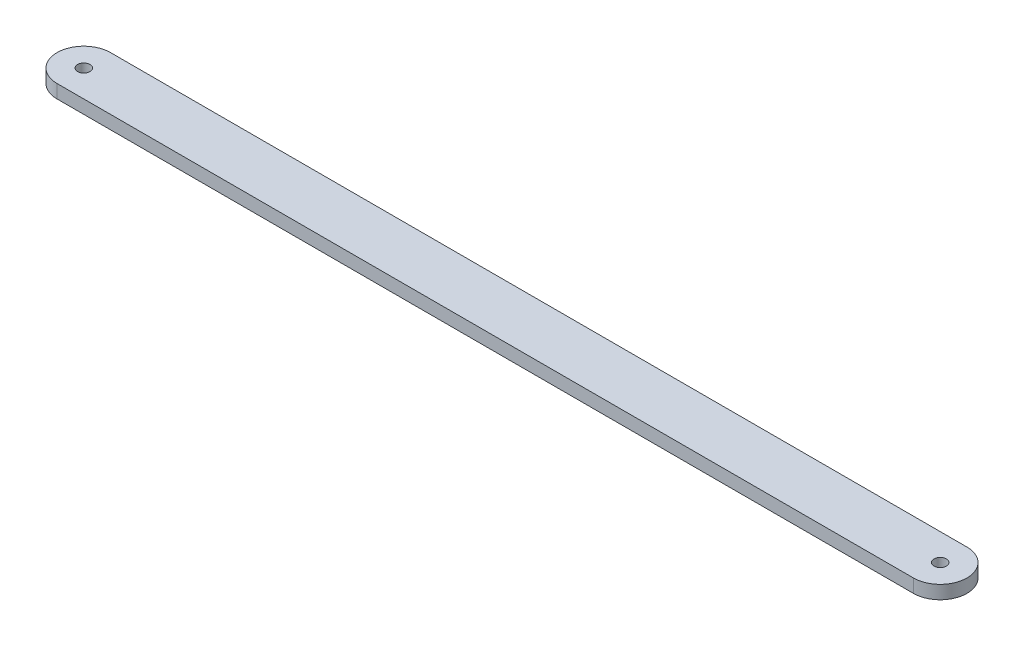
ISO-10303-21;
HEADER;
FILE_DESCRIPTION(('STEP AP214'),'2;1');
FILE_NAME('part.step','',(''),(''),'','','');
FILE_SCHEMA(('AUTOMOTIVE_DESIGN { 1 0 10303 214 1 1 1 1 }'));
ENDSEC;
DATA;
#1=APPLICATION_CONTEXT('core data for automotive mechanical design processes');
#2=APPLICATION_PROTOCOL_DEFINITION('international standard','automotive_design',2000,#1);
#3=PRODUCT_CONTEXT('',#1,'mechanical');
#4=PRODUCT('Part','Part','',(#3));
#5=PRODUCT_RELATED_PRODUCT_CATEGORY('part','',(#4));
#6=PRODUCT_DEFINITION_FORMATION('','',#4);
#7=PRODUCT_DEFINITION_CONTEXT('part definition',#1,'design');
#8=PRODUCT_DEFINITION('design','',#6,#7);
#9=PRODUCT_DEFINITION_SHAPE('','',#8);
#10=(LENGTH_UNIT() NAMED_UNIT(*) SI_UNIT(.MILLI.,.METRE.));
#11=(NAMED_UNIT(*) PLANE_ANGLE_UNIT() SI_UNIT($,.RADIAN.));
#12=(NAMED_UNIT(*) SI_UNIT($,.STERADIAN.) SOLID_ANGLE_UNIT());
#13=UNCERTAINTY_MEASURE_WITH_UNIT(LENGTH_MEASURE(1.E-05),#10,'distance_accuracy_value','');
#14=(GEOMETRIC_REPRESENTATION_CONTEXT(3) GLOBAL_UNCERTAINTY_ASSIGNED_CONTEXT((#13)) GLOBAL_UNIT_ASSIGNED_CONTEXT((#10,
#11,#12)) REPRESENTATION_CONTEXT('',''));
#15=CARTESIAN_POINT('',(0.,0.,0.));
#16=DIRECTION('',(0.,0.,1.));
#17=DIRECTION('',(1.,0.,0.));
#18=AXIS2_PLACEMENT_3D('',#15,#16,#17);
#19=CARTESIAN_POINT('',(0.,3.175,0.));
#20=DIRECTION('',(0.,-1.,0.));
#21=DIRECTION('',(0.,0.,-1.));
#22=AXIS2_PLACEMENT_3D('',#19,#20,#21);
#23=CYLINDRICAL_SURFACE('',#22,6.35);
#24=CARTESIAN_POINT('',(0.,0.,0.));
#25=DIRECTION('',(0.,1.,0.));
#26=DIRECTION('',(0.,0.,1.));
#27=AXIS2_PLACEMENT_3D('',#24,#25,#26);
#28=CIRCLE('',#27,6.35);
#29=CARTESIAN_POINT('',(0.,0.,-6.35));
#30=VERTEX_POINT('',#29);
#31=CARTESIAN_POINT('',(0.,0.,6.35));
#32=VERTEX_POINT('',#31);
#33=EDGE_CURVE('E98',#30,#32,#28,.T.);
#34=ORIENTED_EDGE('',*,*,#33,.T.);
#35=DIRECTION('',(0.,-1.,0.));
#36=VECTOR('',#35,1.);
#37=CARTESIAN_POINT('',(0.,3.175,6.35));
#38=LINE('',#37,#36);
#39=CARTESIAN_POINT('',(0.,3.175,6.35));
#40=VERTEX_POINT('',#39);
#41=EDGE_CURVE('E11',#40,#32,#38,.T.);
#42=ORIENTED_EDGE('',*,*,#41,.F.);
#43=CARTESIAN_POINT('',(0.,3.175,0.));
#44=DIRECTION('',(0.,1.,0.));
#45=DIRECTION('',(0.,0.,1.));
#46=AXIS2_PLACEMENT_3D('',#43,#44,#45);
#47=CIRCLE('',#46,6.35);
#48=CARTESIAN_POINT('',(0.,3.175,-6.35));
#49=VERTEX_POINT('',#48);
#50=EDGE_CURVE('E85',#49,#40,#47,.T.);
#51=ORIENTED_EDGE('',*,*,#50,.F.);
#52=DIRECTION('',(0.,-1.,0.));
#53=VECTOR('',#52,1.);
#54=CARTESIAN_POINT('',(0.,3.175,-6.35));
#55=LINE('',#54,#53);
#56=EDGE_CURVE('E94',#49,#30,#55,.T.);
#57=ORIENTED_EDGE('',*,*,#56,.T.);
#58=EDGE_LOOP('',(#34,#42,#51,#57));
#59=FACE_BOUND('',#58,.T.);
#60=ADVANCED_FACE('F33',(#59),#23,.T.);
#61=CARTESIAN_POINT('',(0.,3.175,6.35));
#62=DIRECTION('',(0.,0.,-1.));
#63=DIRECTION('',(-1.,0.,0.));
#64=AXIS2_PLACEMENT_3D('',#61,#62,#63);
#65=PLANE('',#64);
#66=DIRECTION('',(1.,0.,0.));
#67=VECTOR('',#66,1.);
#68=CARTESIAN_POINT('',(0.,0.,6.35));
#69=LINE('',#68,#67);
#70=CARTESIAN_POINT('',(203.2,0.,6.35));
#71=VERTEX_POINT('',#70);
#72=EDGE_CURVE('E89',#32,#71,#69,.T.);
#73=ORIENTED_EDGE('',*,*,#72,.T.);
#74=DIRECTION('',(0.,-1.,0.));
#75=VECTOR('',#74,1.);
#76=CARTESIAN_POINT('',(203.2,3.175,6.35));
#77=LINE('',#76,#75);
#78=CARTESIAN_POINT('',(203.2,3.175,6.35));
#79=VERTEX_POINT('',#78);
#80=EDGE_CURVE('E42',#79,#71,#77,.T.);
#81=ORIENTED_EDGE('',*,*,#80,.F.);
#82=DIRECTION('',(1.,0.,0.));
#83=VECTOR('',#82,1.);
#84=CARTESIAN_POINT('',(0.,3.175,6.35));
#85=LINE('',#84,#83);
#86=EDGE_CURVE('E80',#40,#79,#85,.T.);
#87=ORIENTED_EDGE('',*,*,#86,.F.);
#88=ORIENTED_EDGE('',*,*,#41,.T.);
#89=EDGE_LOOP('',(#73,#81,#87,#88));
#90=FACE_BOUND('',#89,.T.);
#91=ADVANCED_FACE('F88',(#90),#65,.F.);
#92=CARTESIAN_POINT('',(203.2,3.175,0.));
#93=DIRECTION('',(0.,-1.,0.));
#94=DIRECTION('',(0.,0.,-1.));
#95=AXIS2_PLACEMENT_3D('',#92,#93,#94);
#96=CYLINDRICAL_SURFACE('',#95,6.35);
#97=CARTESIAN_POINT('',(203.2,0.,0.));
#98=DIRECTION('',(0.,1.,0.));
#99=DIRECTION('',(0.,0.,1.));
#100=AXIS2_PLACEMENT_3D('',#97,#98,#99);
#101=CIRCLE('',#100,6.35);
#102=CARTESIAN_POINT('',(203.2,0.,-6.35));
#103=VERTEX_POINT('',#102);
#104=EDGE_CURVE('E67',#71,#103,#101,.T.);
#105=ORIENTED_EDGE('',*,*,#104,.T.);
#106=DIRECTION('',(0.,-1.,0.));
#107=VECTOR('',#106,1.);
#108=CARTESIAN_POINT('',(203.2,3.175,-6.35));
#109=LINE('',#108,#107);
#110=CARTESIAN_POINT('',(203.2,3.175,-6.35));
#111=VERTEX_POINT('',#110);
#112=EDGE_CURVE('E90',#111,#103,#109,.T.);
#113=ORIENTED_EDGE('',*,*,#112,.F.);
#114=CARTESIAN_POINT('',(203.2,3.175,0.));
#115=DIRECTION('',(0.,1.,0.));
#116=DIRECTION('',(0.,0.,1.));
#117=AXIS2_PLACEMENT_3D('',#114,#115,#116);
#118=CIRCLE('',#117,6.35);
#119=EDGE_CURVE('E83',#79,#111,#118,.T.);
#120=ORIENTED_EDGE('',*,*,#119,.F.);
#121=ORIENTED_EDGE('',*,*,#80,.T.);
#122=EDGE_LOOP('',(#105,#113,#120,#121));
#123=FACE_BOUND('',#122,.T.);
#124=ADVANCED_FACE('F92',(#123),#96,.T.);
#125=CARTESIAN_POINT('',(0.,3.175,-6.35));
#126=DIRECTION('',(0.,0.,1.));
#127=DIRECTION('',(1.,0.,0.));
#128=AXIS2_PLACEMENT_3D('',#125,#126,#127);
#129=PLANE('',#128);
#130=DIRECTION('',(-1.,0.,0.));
#131=VECTOR('',#130,1.);
#132=CARTESIAN_POINT('',(0.,0.,-6.35));
#133=LINE('',#132,#131);
#134=EDGE_CURVE('E73',#103,#30,#133,.T.);
#135=ORIENTED_EDGE('',*,*,#134,.T.);
#136=ORIENTED_EDGE('',*,*,#56,.F.);
#137=DIRECTION('',(-1.,0.,0.));
#138=VECTOR('',#137,1.);
#139=CARTESIAN_POINT('',(0.,3.175,-6.35));
#140=LINE('',#139,#138);
#141=EDGE_CURVE('E50',#111,#49,#140,.T.);
#142=ORIENTED_EDGE('',*,*,#141,.F.);
#143=ORIENTED_EDGE('',*,*,#112,.T.);
#144=EDGE_LOOP('',(#135,#136,#142,#143));
#145=FACE_BOUND('',#144,.T.);
#146=ADVANCED_FACE('F106',(#145),#129,.F.);
#147=CARTESIAN_POINT('',(0.,3.175,0.));
#148=DIRECTION('',(0.,1.,0.));
#149=DIRECTION('',(0.,0.,1.));
#150=AXIS2_PLACEMENT_3D('',#147,#148,#149);
#151=PLANE('',#150);
#152=CARTESIAN_POINT('',(0.,3.175,0.));
#153=DIRECTION('',(0.,1.,0.));
#154=DIRECTION('',(0.,0.,1.));
#155=AXIS2_PLACEMENT_3D('',#152,#153,#154);
#156=CIRCLE('',#155,1.47319999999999);
#157=CARTESIAN_POINT('',(0.,3.175,1.47319999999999));
#158=VERTEX_POINT('',#157);
#159=EDGE_CURVE('E117',#158,#158,#156,.T.);
#160=ORIENTED_EDGE('',*,*,#159,.F.);
#161=EDGE_LOOP('',(#160));
#162=FACE_BOUND('',#161,.T.);
#163=CARTESIAN_POINT('',(203.2,3.175,0.));
#164=DIRECTION('',(0.,1.,0.));
#165=DIRECTION('',(0.,0.,1.));
#166=AXIS2_PLACEMENT_3D('',#163,#164,#165);
#167=CIRCLE('',#166,1.47319999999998);
#168=CARTESIAN_POINT('',(203.2,3.175,1.47319999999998));
#169=VERTEX_POINT('',#168);
#170=EDGE_CURVE('E114',#169,#169,#167,.T.);
#171=ORIENTED_EDGE('',*,*,#170,.F.);
#172=EDGE_LOOP('',(#171));
#173=FACE_BOUND('',#172,.T.);
#174=ORIENTED_EDGE('',*,*,#50,.T.);
#175=ORIENTED_EDGE('',*,*,#86,.T.);
#176=ORIENTED_EDGE('',*,*,#119,.T.);
#177=ORIENTED_EDGE('',*,*,#141,.T.);
#178=EDGE_LOOP('',(#174,#175,#176,#177));
#179=FACE_BOUND('',#178,.T.);
#180=ADVANCED_FACE('F81',(#162,#173,#179),#151,.T.);
#181=CARTESIAN_POINT('',(0.,0.,0.));
#182=DIRECTION('',(0.,1.,0.));
#183=DIRECTION('',(0.,0.,1.));
#184=AXIS2_PLACEMENT_3D('',#181,#182,#183);
#185=PLANE('',#184);
#186=CARTESIAN_POINT('',(0.,0.,0.));
#187=DIRECTION('',(0.,1.,0.));
#188=DIRECTION('',(0.,0.,1.));
#189=AXIS2_PLACEMENT_3D('',#186,#187,#188);
#190=CIRCLE('',#189,1.47319999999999);
#191=CARTESIAN_POINT('',(0.,0.,1.47319999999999));
#192=VERTEX_POINT('',#191);
#193=EDGE_CURVE('E36',#192,#192,#190,.T.);
#194=ORIENTED_EDGE('',*,*,#193,.T.);
#195=EDGE_LOOP('',(#194));
#196=FACE_BOUND('',#195,.T.);
#197=CARTESIAN_POINT('',(203.2,0.,0.));
#198=DIRECTION('',(0.,1.,0.));
#199=DIRECTION('',(0.,0.,1.));
#200=AXIS2_PLACEMENT_3D('',#197,#198,#199);
#201=CIRCLE('',#200,1.47319999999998);
#202=CARTESIAN_POINT('',(203.2,0.,1.47319999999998));
#203=VERTEX_POINT('',#202);
#204=EDGE_CURVE('E101',#203,#203,#201,.T.);
#205=ORIENTED_EDGE('',*,*,#204,.T.);
#206=EDGE_LOOP('',(#205));
#207=FACE_BOUND('',#206,.T.);
#208=ORIENTED_EDGE('',*,*,#33,.F.);
#209=ORIENTED_EDGE('',*,*,#134,.F.);
#210=ORIENTED_EDGE('',*,*,#104,.F.);
#211=ORIENTED_EDGE('',*,*,#72,.F.);
#212=EDGE_LOOP('',(#208,#209,#210,#211));
#213=FACE_BOUND('',#212,.T.);
#214=ADVANCED_FACE('F109',(#196,#207,#213),#185,.F.);
#215=CARTESIAN_POINT('',(203.2,3.175,0.));
#216=DIRECTION('',(0.,1.,0.));
#217=DIRECTION('',(0.,0.,1.));
#218=AXIS2_PLACEMENT_3D('',#215,#216,#217);
#219=CYLINDRICAL_SURFACE('',#218,1.47319999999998);
#220=ORIENTED_EDGE('',*,*,#170,.T.);
#221=EDGE_LOOP('',(#220));
#222=FACE_BOUND('',#221,.T.);
#223=ORIENTED_EDGE('',*,*,#204,.F.);
#224=EDGE_LOOP('',(#223));
#225=FACE_BOUND('',#224,.T.);
#226=ADVANCED_FACE('F128',(#222,#225),#219,.F.);
#227=CARTESIAN_POINT('',(0.,3.175,0.));
#228=DIRECTION('',(0.,1.,0.));
#229=DIRECTION('',(0.,0.,1.));
#230=AXIS2_PLACEMENT_3D('',#227,#228,#229);
#231=CYLINDRICAL_SURFACE('',#230,1.47319999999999);
#232=ORIENTED_EDGE('',*,*,#159,.T.);
#233=EDGE_LOOP('',(#232));
#234=FACE_BOUND('',#233,.T.);
#235=ORIENTED_EDGE('',*,*,#193,.F.);
#236=EDGE_LOOP('',(#235));
#237=FACE_BOUND('',#236,.T.);
#238=ADVANCED_FACE('F126',(#234,#237),#231,.F.);
#239=CLOSED_SHELL('',(#60,#91,#124,#146,#180,#214,#226,#238));
#240=MANIFOLD_SOLID_BREP('B2',#239);
#241=ADVANCED_BREP_SHAPE_REPRESENTATION('',(#18,#240),#14);
#242=SHAPE_DEFINITION_REPRESENTATION(#9,#241);
ENDSEC;
END-ISO-10303-21;
